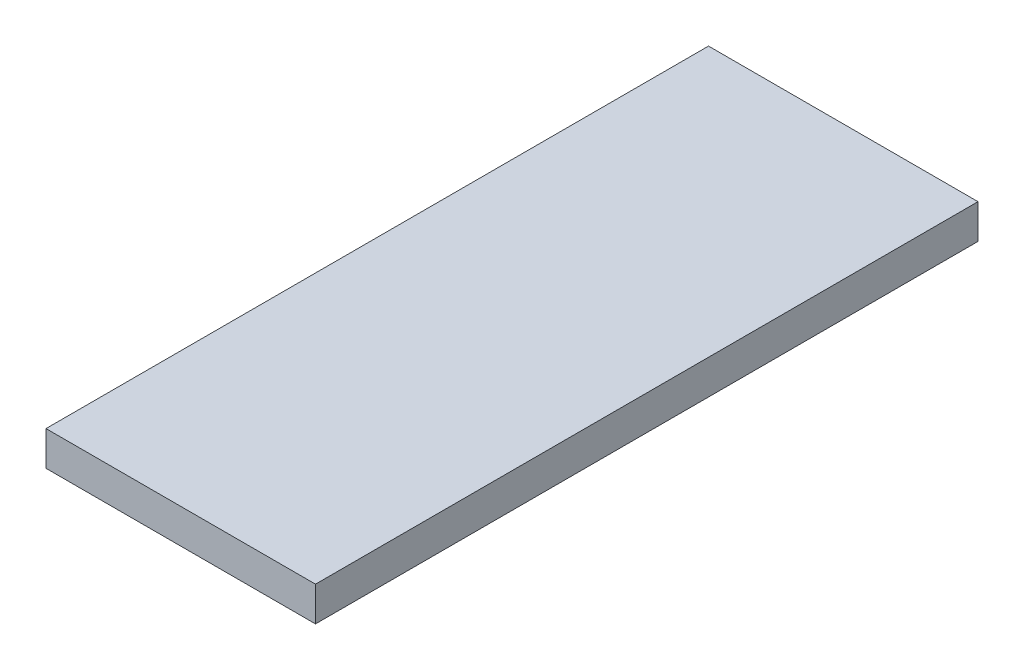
from build123d import *

# Parameters (mm, degrees)
BOSS_EXTRU_1_DEPTH      = 30
BOSS_EXTRU_1_DEPTH_BACK = 30
ESQUISSE1_W             = 24.406448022
ESQUISSE1_H             = 3.119621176


with BuildPart() as part:
    # Esquisse1 → Boss.-Extru.1 (new, two sides: drawn at the far end of the back side and taken through both)
    with BuildSketch(Plane.XY.offset(-BOSS_EXTRU_1_DEPTH_BACK)):
        with Locations((-16.423887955, -3.394881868)):
            Rectangle(ESQUISSE1_W, ESQUISSE1_H)
    extrude(amount=BOSS_EXTRU_1_DEPTH + BOSS_EXTRU_1_DEPTH_BACK)


solid = part.part
